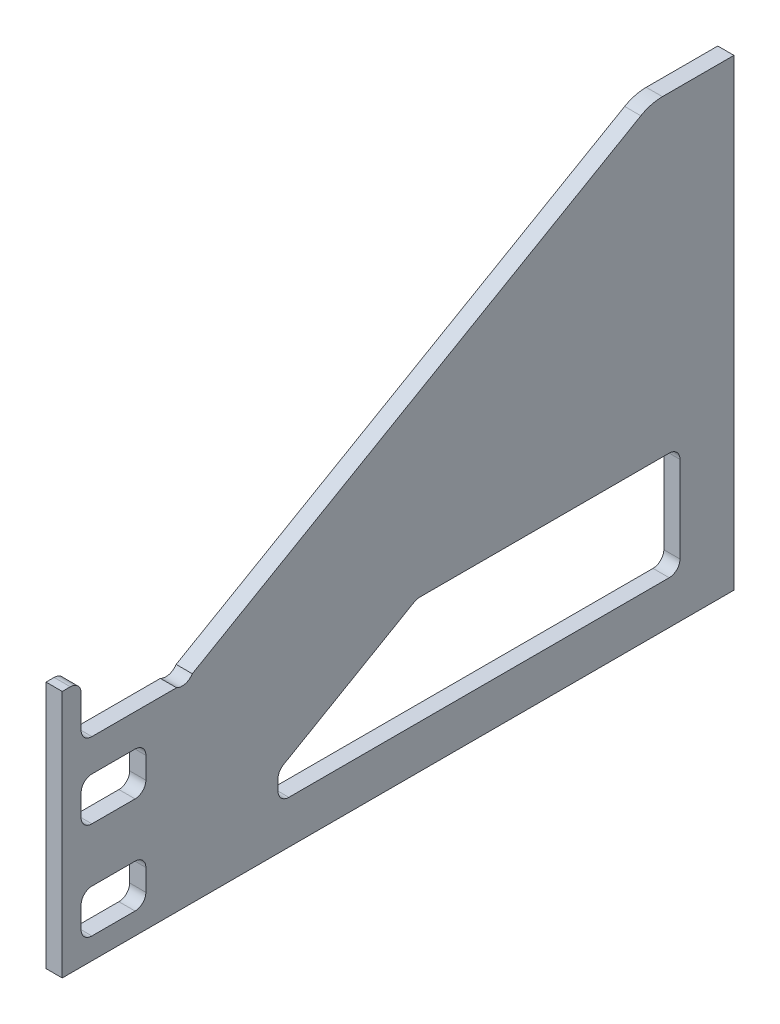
from build123d import *

# Parameters (mm, degrees)
BOSS_EXTRUDE1_DEPTH = 4.7625
CUT_EXTRUDE5_DEPTH  = 393.730546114
CUT_EXTRUDE7_DEPTH  = 393.730546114
SKETCH21_W          = 11.1125
SKETCH21_H          = 31.75
BOSS_EXTRUDE2_DEPTH = 9.525
FILLET4_R           = 6.35
BOSS_EXTRUDE6_DEPTH = 9.525
FILLET5_R           = 25.4
FILLET3_R           = 6.35
SKETCH43_R          = 7.14375
CUT_EXTRUDE8_DEPTH  = 393.730546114


with BuildPart() as part:
    # Sketch1 → Boss-Extrude1 (new, symmetric)
    with BuildSketch(Plane(origin=(0, 0, 0), x_dir=(0, 0, -1), z_dir=(1, 0, 0))):
        Polygon((0, 137.66477381), (0, 114.3), (-112.7125, 114.3), (-112.7125, 0), (282.575, 0), (282.575, 272.576458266), (233.673892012, 272.576458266), align=None)
    extrude(amount=BOSS_EXTRUDE1_DEPTH, both=True)

    # Sketch11 → Cut-Extrude5 (cut, through all)
    with BuildSketch(Plane(origin=(4.7625, 0, 0), x_dir=(0, 0, -1), z_dir=(1, 0, 0))):
        with BuildLine():
            Line((-95.25, 95.25), (-69.85, 95.25))
            ThreePointArc((-69.85, 95.25), (-65.359871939, 93.390128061), (-63.5, 88.9))
            Line((-63.5, 88.9), (-63.5, 76.2))
            ThreePointArc((-63.5, 76.2), (-65.359871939, 71.709871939), (-69.85, 69.85))
            Line((-69.85, 69.85), (-95.25, 69.85))
            ThreePointArc((-95.25, 69.85), (-99.740128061, 71.709871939), (-101.6, 76.2))
            Line((-101.6, 76.2), (-101.6, 88.9))
            ThreePointArc((-101.6, 88.9), (-99.740128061, 93.390128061), (-95.25, 95.25))
        make_face()
        with BuildLine():
            Line((-95.25, 38.1), (-69.85, 38.1))
            ThreePointArc((-69.85, 38.1), (-65.359871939, 36.240128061), (-63.5, 31.75))
            Line((-63.5, 31.75), (-63.5, 19.05))
            ThreePointArc((-63.5, 19.05), (-65.359871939, 14.559871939), (-69.85, 12.7))
            Line((-69.85, 12.7), (-95.25, 12.7))
            ThreePointArc((-95.25, 12.7), (-99.740128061, 14.559871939), (-101.6, 19.05))
            Line((-101.6, 19.05), (-101.6, 31.75))
            ThreePointArc((-101.6, 31.75), (-99.740128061, 36.240128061), (-95.25, 38.1))
        make_face()
    extrude(amount=-CUT_EXTRUDE5_DEPTH, mode=Mode.SUBTRACT)

    # Sketch15 → Cut-Extrude7 (cut, through all)
    with BuildSketch(Plane(origin=(4.7625, 0, 0), x_dir=(0, 0, -1), z_dir=(1, 0, 0))):
        with BuildLine():
            Line((94.452158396, 88.049261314), (17.4625, 43.599261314))
            ThreePointArc((17.4625, 43.599261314), (15.138238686, 41.275), (14.2875, 38.1))
            Line((14.2875, 38.1), (14.2875, 31.75))
            ThreePointArc((14.2875, 31.75), (16.147371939, 27.259871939), (20.6375, 25.4))
            Line((20.6375, 25.4), (244.475, 25.4))
            ThreePointArc((244.475, 25.4), (248.965128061, 27.259871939), (250.825, 31.75))
            Line((250.825, 31.75), (250.825, 82.55))
            ThreePointArc((250.825, 82.55), (248.965128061, 87.040128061), (244.475, 88.9))
            Line((244.475, 88.9), (97.627158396, 88.9))
            ThreePointArc((97.627158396, 88.9), (95.98365746, 88.683628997), (94.452158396, 88.049261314))
        make_face()
    extrude(amount=-CUT_EXTRUDE7_DEPTH, mode=Mode.SUBTRACT)

    # Sketch21 → Boss-Extrude2 (add)
    with BuildSketch(Plane.ZY.offset(4.7625)):
        with Locations((107.15625, 130.175)):
            Rectangle(SKETCH21_W, SKETCH21_H)
    extrude(amount=-BOSS_EXTRUDE2_DEPTH)

    # Fillet4
    fillet4_edges = [part.edges().sort_by_distance(p)[0] for p in [
        (0, 146.05, 101.6),
    ]]
    fillet(fillet4_edges, radius=FILLET4_R)

    # Sketch40 → Boss-Extrude6 (add)
    with BuildSketch(Plane(origin=(4.7625, 0, 0), x_dir=(0, 0, -1), z_dir=(1, 0, 0))):
        Polygon((0, 137.66477381), (-40.468975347, 114.3), (0, 114.3), align=None)
    extrude(amount=-BOSS_EXTRUDE6_DEPTH)

    # Fillet5
    fillet5_edges = [part.edges().sort_by_distance(p)[0] for p in [
        (0, 272.576458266, -233.673892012),
    ]]
    fillet(fillet5_edges, radius=FILLET5_R)

    # Fillet3
    fillet3_edges = [part.edges().sort_by_distance(p)[0] for p in [
        (0, 114.3, 101.6),
        (0, 114.3, 40.468975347),
    ]]
    fillet(fillet3_edges, radius=FILLET3_R)

    # Sketch43 → Cut-Extrude8 (cut, through all)
    with BuildSketch(Plane(origin=(4.7625, 0, 0), x_dir=(0, 0, -1), z_dir=(1, 0, 0))):
        with Locations((-42.170452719, 120.65)):
            Circle(SKETCH43_R)
    extrude(amount=-CUT_EXTRUDE8_DEPTH, mode=Mode.SUBTRACT)


solid = part.part
